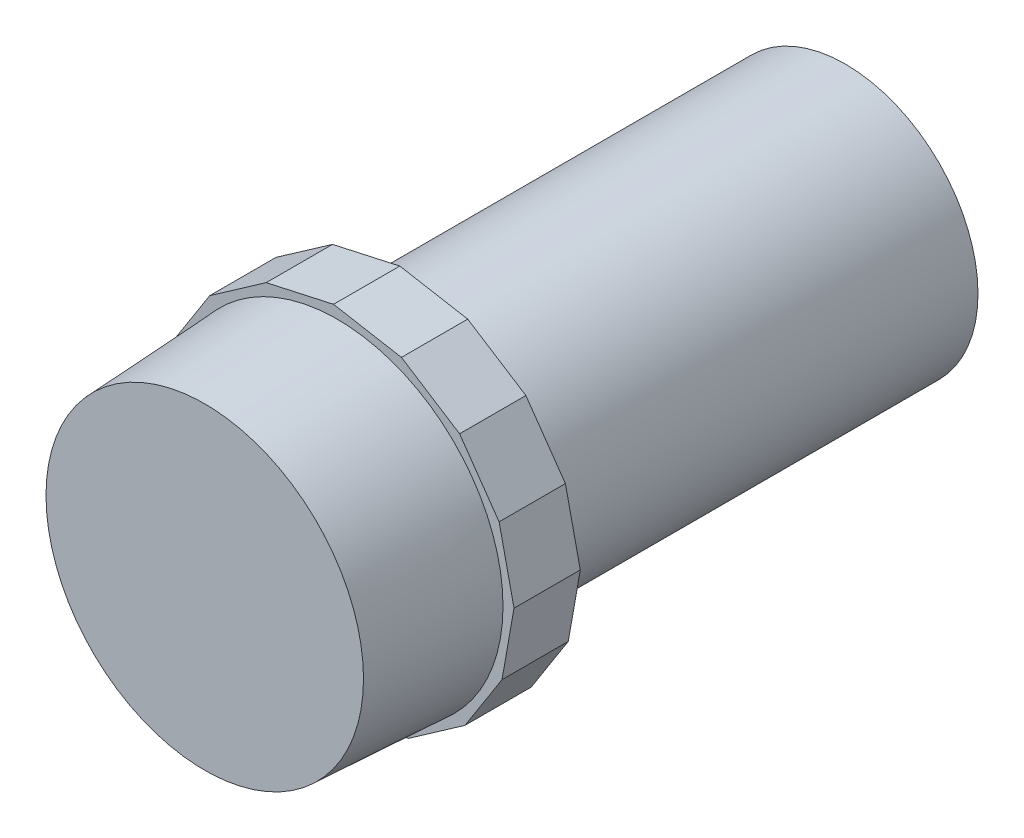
from build123d import *

# Parameters (mm, degrees)
CROQUIS1_R              = 7.5
SALIENTE_EXTRUIR1_DEPTH = 6
SALIENTE_EXTRUIR1_TAPER = 3
CROQUIS2_R              = 8
SALIENTE_EXTRUIR6_DEPTH = 3
CORTAR_EXTRUIR2_START   = -3
CORTAR_EXTRUIR2_DEPTH   = 3
CROQUIS7_R              = 6
SALIENTE_EXTRUIR7_DEPTH = 20


with BuildPart() as part:
    # Croquis1 → Saliente-Extruir1 (new body)
    with BuildSketch(Plane.XY):
        Circle(CROQUIS1_R)
    extrude(amount=SALIENTE_EXTRUIR1_DEPTH, taper=SALIENTE_EXTRUIR1_TAPER)

    # Croquis2 → Saliente-Extruir6 (add)
    with BuildSketch(Plane(origin=(0, 0, 0), x_dir=(-1, 0, 0), z_dir=(0, 0, -1))):
        Circle(CROQUIS2_R)
    extrude(amount=SALIENTE_EXTRUIR6_DEPTH)

    # Croquis6 → Cortar-Extruir2 (cut)
    with BuildSketch(Plane(origin=(0, 0, -3), x_dir=(-1, 0, 0), z_dir=(0, 0, -1)).offset(CORTAR_EXTRUIR2_START)):
        with BuildLine():
            Line((-2.90315926, 7.454640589), (0.170598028, 7.998180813))
            ThreePointArc((0.170598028, 7.998180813), (-1.393047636, 7.877780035), (-2.90315926, 7.454640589))
        make_face()
        with BuildLine():
            Line((0.170598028, 7.998180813), (3.218383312, 7.324070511))
            ThreePointArc((3.218383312, 7.324070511), (1.727687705, 7.811215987), (0.170598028, 7.998180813))
        make_face()
        with BuildLine():
            Line((3.218383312, 7.324070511), (5.776198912, 5.534936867))
            ThreePointArc((5.776198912, 5.534936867), (4.585398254, 6.555465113), (3.218383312, 7.324070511))
        make_face()
        with BuildLine():
            Line((5.776198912, 5.534936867), (7.454640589, 2.90315926))
            ThreePointArc((7.454640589, 2.90315926), (6.745023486, 4.301704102), (5.776198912, 5.534936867))
        make_face()
        with BuildLine():
            Line((7.454640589, 2.90315926), (7.998180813, -0.170598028))
            ThreePointArc((7.998180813, -0.170598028), (7.99954519, -0.085303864), (8, 0))
            ThreePointArc((8, 0), (7.862478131, 1.476969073), (7.454640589, 2.90315926))
        make_face()
        with BuildLine():
            Line((7.998180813, -0.170598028), (7.324070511, -3.218383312))
            ThreePointArc((7.324070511, -3.218383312), (7.811215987, -1.727687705), (7.998180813, -0.170598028))
        make_face()
        with BuildLine():
            ThreePointArc((5.534936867, -5.776198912), (6.555465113, -4.585398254), (7.324070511, -3.218383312))
            Line((7.324070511, -3.218383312), (5.534936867, -5.776198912))
        make_face()
        with BuildLine():
            ThreePointArc((2.90315926, -7.454640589), (4.301704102, -6.745023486), (5.534936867, -5.776198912))
            Line((5.534936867, -5.776198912), (2.90315926, -7.454640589))
        make_face()
        with BuildLine():
            ThreePointArc((-0.170598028, -7.998180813), (1.393047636, -7.877780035), (2.90315926, -7.454640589))
            Line((2.90315926, -7.454640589), (-0.170598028, -7.998180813))
        make_face()
        with BuildLine():
            ThreePointArc((-5.776198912, -5.534936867), (-4.585398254, -6.555465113), (-3.218383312, -7.324070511))
            Line((-3.218383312, -7.324070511), (-5.776198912, -5.534936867))
        make_face()
        with BuildLine():
            ThreePointArc((-3.218383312, -7.324070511), (-1.727687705, -7.811215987), (-0.170598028, -7.998180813))
            Line((-0.170598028, -7.998180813), (-3.218383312, -7.324070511))
        make_face()
        with BuildLine():
            ThreePointArc((-7.454640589, -2.90315926), (-6.745023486, -4.301704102), (-5.776198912, -5.534936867))
            Line((-5.776198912, -5.534936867), (-7.454640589, -2.90315926))
        make_face()
        with BuildLine():
            ThreePointArc((-7.998180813, 0.170598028), (-7.877780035, -1.393047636), (-7.454640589, -2.90315926))
            Line((-7.454640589, -2.90315926), (-7.998180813, 0.170598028))
        make_face()
        with BuildLine():
            ThreePointArc((-7.324070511, 3.218383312), (-7.811215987, 1.727687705), (-7.998180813, 0.170598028))
            Line((-7.998180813, 0.170598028), (-7.324070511, 3.218383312))
        make_face()
        with BuildLine():
            Line((-7.324070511, 3.218383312), (-5.534936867, 5.776198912))
            ThreePointArc((-5.534936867, 5.776198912), (-6.555465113, 4.585398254), (-7.324070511, 3.218383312))
        make_face()
        with BuildLine():
            Line((-5.534936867, 5.776198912), (-2.90315926, 7.454640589))
            ThreePointArc((-2.90315926, 7.454640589), (-4.301704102, 6.745023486), (-5.534936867, 5.776198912))
        make_face()
    extrude(amount=CORTAR_EXTRUIR2_DEPTH, mode=Mode.SUBTRACT)

    # Croquis7 → Saliente-Extruir7 (add)
    with BuildSketch(Plane(origin=(0, 0, -3), x_dir=(-1, 0, 0), z_dir=(0, 0, -1))):
        Circle(CROQUIS7_R)
    extrude(amount=SALIENTE_EXTRUIR7_DEPTH)


solid = part.part
